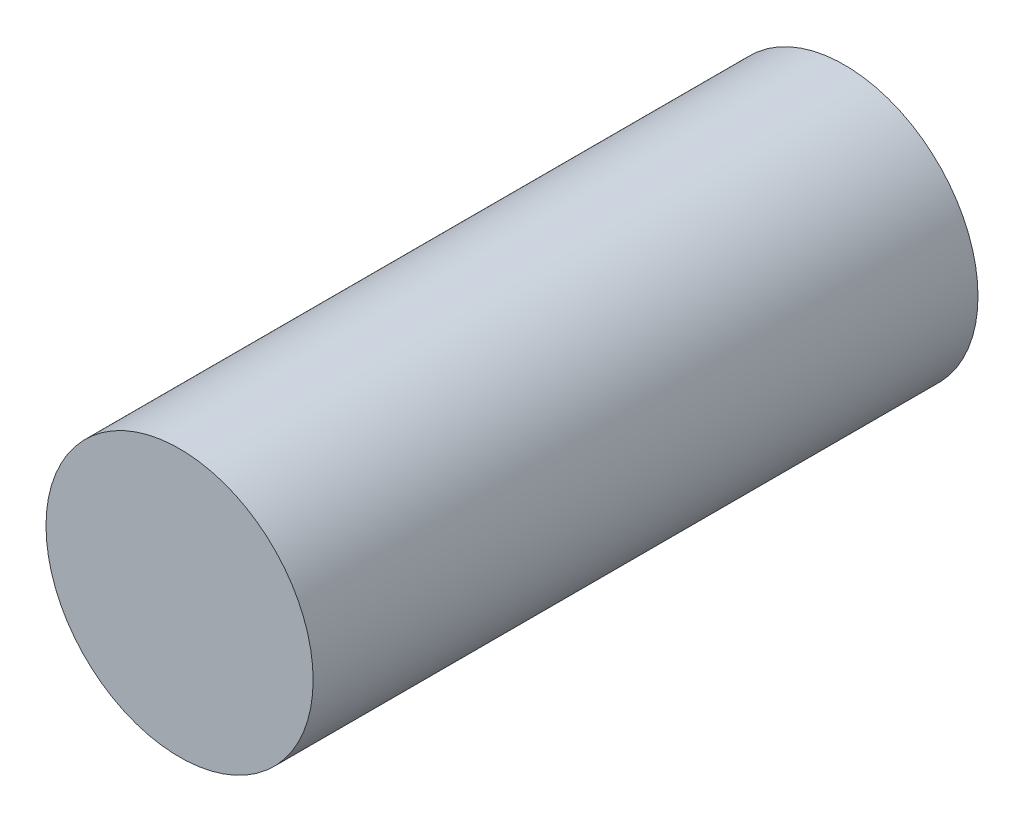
from build123d import *

# Parameters (mm, degrees)
SKETCH1_R           = 112.5
BOSS_EXTRUDE1_DEPTH = 280


with BuildPart() as part:
    # Sketch1 → Boss-Extrude1 (new, symmetric)
    with BuildSketch(Plane.XY):
        Circle(SKETCH1_R)
    extrude(amount=BOSS_EXTRUDE1_DEPTH, both=True)


solid = part.part
